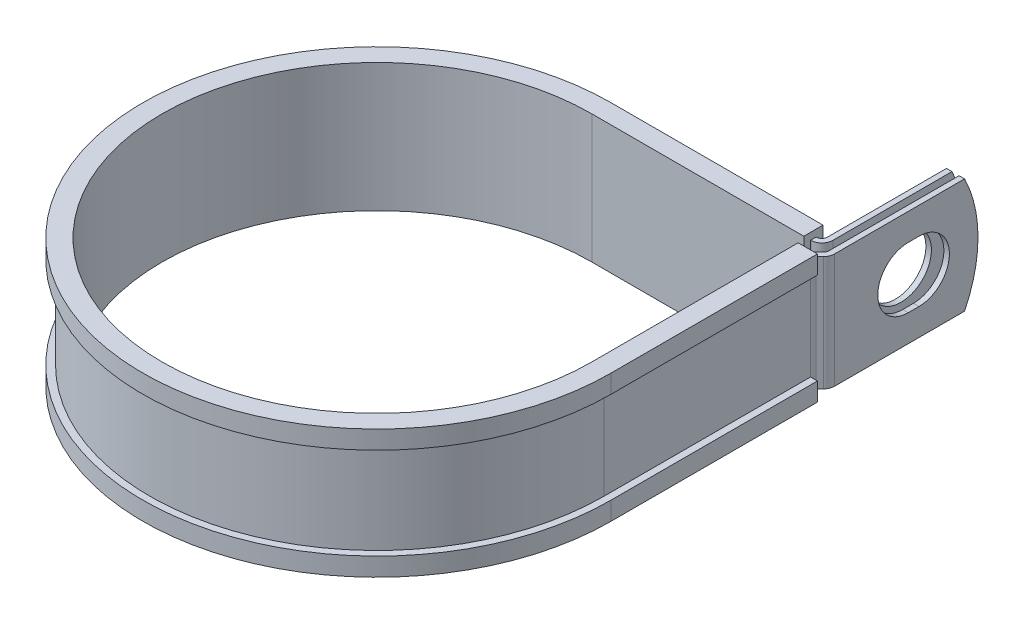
ISO-10303-21;
HEADER;
FILE_DESCRIPTION(('STEP AP214'),'2;1');
FILE_NAME('part.step','',(''),(''),'','','');
FILE_SCHEMA(('AUTOMOTIVE_DESIGN { 1 0 10303 214 1 1 1 1 }'));
ENDSEC;
DATA;
#1=APPLICATION_CONTEXT('core data for automotive mechanical design processes');
#2=APPLICATION_PROTOCOL_DEFINITION('international standard','automotive_design',2000,#1);
#3=PRODUCT_CONTEXT('',#1,'mechanical');
#4=PRODUCT('Part','Part','',(#3));
#5=PRODUCT_RELATED_PRODUCT_CATEGORY('part','',(#4));
#6=PRODUCT_DEFINITION_FORMATION('','',#4);
#7=PRODUCT_DEFINITION_CONTEXT('part definition',#1,'design');
#8=PRODUCT_DEFINITION('design','',#6,#7);
#9=PRODUCT_DEFINITION_SHAPE('','',#8);
#10=(LENGTH_UNIT() NAMED_UNIT(*) SI_UNIT(.MILLI.,.METRE.));
#11=(NAMED_UNIT(*) PLANE_ANGLE_UNIT() SI_UNIT($,.RADIAN.));
#12=(NAMED_UNIT(*) SI_UNIT($,.STERADIAN.) SOLID_ANGLE_UNIT());
#13=UNCERTAINTY_MEASURE_WITH_UNIT(LENGTH_MEASURE(1.E-05),#10,'distance_accuracy_value','');
#14=(GEOMETRIC_REPRESENTATION_CONTEXT(3) GLOBAL_UNCERTAINTY_ASSIGNED_CONTEXT((#13)) GLOBAL_UNIT_ASSIGNED_CONTEXT((#10,
#11,#12)) REPRESENTATION_CONTEXT('',''));
#15=CARTESIAN_POINT('',(0.,0.,0.));
#16=DIRECTION('',(0.,0.,1.));
#17=DIRECTION('',(1.,0.,0.));
#18=AXIS2_PLACEMENT_3D('',#15,#16,#17);
#19=CARTESIAN_POINT('',(49.8272698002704,-12.7,-49.149));
#20=DIRECTION('',(0.,1.,0.));
#21=DIRECTION('',(1.,0.,0.));
#22=AXIS2_PLACEMENT_3D('',#19,#20,#21);
#23=PLANE('',#22);
#24=DIRECTION('',(0.,0.,-1.));
#25=VECTOR('',#24,1.);
#26=CARTESIAN_POINT('',(46.9824698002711,-12.7,-49.149));
#27=LINE('',#26,#25);
#28=CARTESIAN_POINT('',(46.9824698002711,-12.7,-49.149));
#29=VERTEX_POINT('',#28);
#30=CARTESIAN_POINT('',(46.9824698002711,-12.7,-50.3682));
#31=VERTEX_POINT('',#30);
#32=EDGE_CURVE('E524',#29,#31,#27,.T.);
#33=ORIENTED_EDGE('',*,*,#32,.T.);
#34=DIRECTION('',(1.,0.,0.));
#35=VECTOR('',#34,1.);
#36=CARTESIAN_POINT('',(0.,-12.7,-50.3682));
#37=LINE('',#36,#35);
#38=CARTESIAN_POINT('',(47.0332698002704,-12.7,-50.3682));
#39=VERTEX_POINT('',#38);
#40=EDGE_CURVE('E411',#39,#31,#37,.F.);
#41=ORIENTED_EDGE('',*,*,#40,.F.);
#42=CARTESIAN_POINT('',(47.0332698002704,-12.7,-51.5874));
#43=DIRECTION('',(0.,1.,0.));
#44=DIRECTION('',(1.,0.,0.));
#45=AXIS2_PLACEMENT_3D('',#42,#43,#44);
#46=CIRCLE('',#45,1.2192);
#47=CARTESIAN_POINT('',(48.2524698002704,-12.7,-51.5874));
#48=VERTEX_POINT('',#47);
#49=EDGE_CURVE('E409',#48,#39,#46,.F.);
#50=ORIENTED_EDGE('',*,*,#49,.F.);
#51=DIRECTION('',(0.,0.,1.));
#52=VECTOR('',#51,1.);
#53=CARTESIAN_POINT('',(48.2524698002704,-12.7,-80.9498));
#54=LINE('',#53,#52);
#55=CARTESIAN_POINT('',(48.2524698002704,-12.7,-77.9724683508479));
#56=VERTEX_POINT('',#55);
#57=EDGE_CURVE('E407',#56,#48,#54,.T.);
#58=ORIENTED_EDGE('',*,*,#57,.F.);
#59=DIRECTION('',(-1.,0.,0.));
#60=VECTOR('',#59,1.);
#61=CARTESIAN_POINT('',(52.2656698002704,-12.7,-77.9724683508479));
#62=LINE('',#61,#60);
#63=CARTESIAN_POINT('',(49.4716698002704,-12.7,-77.9724683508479));
#64=VERTEX_POINT('',#63);
#65=EDGE_CURVE('E12',#64,#56,#62,.T.);
#66=ORIENTED_EDGE('',*,*,#65,.F.);
#67=DIRECTION('',(0.,0.,1.));
#68=VECTOR('',#67,1.);
#69=CARTESIAN_POINT('',(49.4716698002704,-12.7,-80.9498));
#70=LINE('',#69,#68);
#71=CARTESIAN_POINT('',(49.4716698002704,-12.7,-51.5874));
#72=VERTEX_POINT('',#71);
#73=EDGE_CURVE('E405',#64,#72,#70,.T.);
#74=ORIENTED_EDGE('',*,*,#73,.T.);
#75=CARTESIAN_POINT('',(47.0332698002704,-12.7,-51.5874));
#76=DIRECTION('',(0.,-1.,0.));
#77=DIRECTION('',(0.,0.,1.));
#78=AXIS2_PLACEMENT_3D('',#75,#76,#77);
#79=CIRCLE('',#78,2.4384);
#80=CARTESIAN_POINT('',(47.0332698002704,-12.7,-49.149));
#81=VERTEX_POINT('',#80);
#82=EDGE_CURVE('E402',#72,#81,#79,.T.);
#83=ORIENTED_EDGE('',*,*,#82,.T.);
#84=DIRECTION('',(-1.,0.,0.));
#85=VECTOR('',#84,1.);
#86=CARTESIAN_POINT('',(0.,-12.7,-49.149));
#87=LINE('',#86,#85);
#88=EDGE_CURVE('E399',#81,#29,#87,.T.);
#89=ORIENTED_EDGE('',*,*,#88,.T.);
#90=EDGE_LOOP('',(#33,#41,#50,#58,#66,#74,#83,#89));
#91=FACE_BOUND('',#90,.T.);
#92=ADVANCED_FACE('F55',(#91),#23,.F.);
#93=CARTESIAN_POINT('',(49.8272698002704,12.7,-49.149));
#94=DIRECTION('',(0.,1.,0.));
#95=DIRECTION('',(1.,0.,0.));
#96=AXIS2_PLACEMENT_3D('',#93,#94,#95);
#97=PLANE('',#96);
#98=DIRECTION('',(1.,0.,0.));
#99=VECTOR('',#98,1.);
#100=CARTESIAN_POINT('',(0.,12.7,-50.3682));
#101=LINE('',#100,#99);
#102=CARTESIAN_POINT('',(47.0332698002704,12.7,-50.3682));
#103=VERTEX_POINT('',#102);
#104=CARTESIAN_POINT('',(46.9824698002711,12.7,-50.3682));
#105=VERTEX_POINT('',#104);
#106=EDGE_CURVE('E369',#103,#105,#101,.F.);
#107=ORIENTED_EDGE('',*,*,#106,.T.);
#108=DIRECTION('',(0.,0.,1.));
#109=VECTOR('',#108,1.);
#110=CARTESIAN_POINT('',(46.9824698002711,12.7,-50.3682));
#111=LINE('',#110,#109);
#112=CARTESIAN_POINT('',(46.9824698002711,12.7,-49.149));
#113=VERTEX_POINT('',#112);
#114=EDGE_CURVE('E518',#105,#113,#111,.T.);
#115=ORIENTED_EDGE('',*,*,#114,.T.);
#116=DIRECTION('',(-1.,0.,0.));
#117=VECTOR('',#116,1.);
#118=CARTESIAN_POINT('',(0.,12.7,-49.149));
#119=LINE('',#118,#117);
#120=CARTESIAN_POINT('',(47.0332698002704,12.7,-49.149));
#121=VERTEX_POINT('',#120);
#122=EDGE_CURVE('E626',#121,#113,#119,.T.);
#123=ORIENTED_EDGE('',*,*,#122,.F.);
#124=CARTESIAN_POINT('',(47.0332698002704,12.7,-51.5874));
#125=DIRECTION('',(0.,-1.,0.));
#126=DIRECTION('',(0.,0.,1.));
#127=AXIS2_PLACEMENT_3D('',#124,#125,#126);
#128=CIRCLE('',#127,2.4384);
#129=CARTESIAN_POINT('',(49.4716698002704,12.7,-51.5874));
#130=VERTEX_POINT('',#129);
#131=EDGE_CURVE('E371',#130,#121,#128,.T.);
#132=ORIENTED_EDGE('',*,*,#131,.F.);
#133=DIRECTION('',(0.,0.,1.));
#134=VECTOR('',#133,1.);
#135=CARTESIAN_POINT('',(49.4716698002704,12.7,-80.9498));
#136=LINE('',#135,#134);
#137=CARTESIAN_POINT('',(49.4716698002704,12.7,-77.9724683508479));
#138=VERTEX_POINT('',#137);
#139=EDGE_CURVE('E362',#138,#130,#136,.T.);
#140=ORIENTED_EDGE('',*,*,#139,.F.);
#141=DIRECTION('',(-1.,0.,0.));
#142=VECTOR('',#141,1.);
#143=CARTESIAN_POINT('',(52.2656698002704,12.7,-77.9724683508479));
#144=LINE('',#143,#142);
#145=CARTESIAN_POINT('',(48.2524698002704,12.7,-77.9724683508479));
#146=VERTEX_POINT('',#145);
#147=EDGE_CURVE('E63',#138,#146,#144,.T.);
#148=ORIENTED_EDGE('',*,*,#147,.T.);
#149=DIRECTION('',(0.,0.,1.));
#150=VECTOR('',#149,1.);
#151=CARTESIAN_POINT('',(48.2524698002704,12.7,-80.9498));
#152=LINE('',#151,#150);
#153=CARTESIAN_POINT('',(48.2524698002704,12.7,-51.5874));
#154=VERTEX_POINT('',#153);
#155=EDGE_CURVE('E359',#146,#154,#152,.T.);
#156=ORIENTED_EDGE('',*,*,#155,.T.);
#157=CARTESIAN_POINT('',(47.0332698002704,12.7,-51.5874));
#158=DIRECTION('',(0.,1.,0.));
#159=DIRECTION('',(1.,0.,0.));
#160=AXIS2_PLACEMENT_3D('',#157,#158,#159);
#161=CIRCLE('',#160,1.2192);
#162=EDGE_CURVE('E367',#154,#103,#161,.F.);
#163=ORIENTED_EDGE('',*,*,#162,.T.);
#164=EDGE_LOOP('',(#107,#115,#123,#132,#140,#148,#156,#163));
#165=FACE_BOUND('',#164,.T.);
#166=ADVANCED_FACE('F358',(#165),#97,.T.);
#167=CARTESIAN_POINT('',(0.,12.7,-49.149));
#168=DIRECTION('',(0.,0.,1.));
#169=DIRECTION('',(1.,0.,0.));
#170=AXIS2_PLACEMENT_3D('',#167,#168,#169);
#171=PLANE('',#170);
#172=ORIENTED_EDGE('',*,*,#122,.T.);
#173=DIRECTION('',(0.,-1.,0.));
#174=VECTOR('',#173,1.);
#175=CARTESIAN_POINT('',(46.9824698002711,12.7,-49.149));
#176=LINE('',#175,#174);
#177=EDGE_CURVE('E521',#113,#29,#176,.T.);
#178=ORIENTED_EDGE('',*,*,#177,.T.);
#179=ORIENTED_EDGE('',*,*,#88,.F.);
#180=DIRECTION('',(0.,-1.,0.));
#181=VECTOR('',#180,1.);
#182=CARTESIAN_POINT('',(47.0332698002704,12.7,-49.149));
#183=LINE('',#182,#181);
#184=EDGE_CURVE('E345',#121,#81,#183,.T.);
#185=ORIENTED_EDGE('',*,*,#184,.F.);
#186=EDGE_LOOP('',(#172,#178,#179,#185));
#187=FACE_BOUND('',#186,.T.);
#188=ADVANCED_FACE('F636',(#187),#171,.T.);
#189=CARTESIAN_POINT('',(52.2656698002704,12.7,-49.149));
#190=DIRECTION('',(-1.,0.,0.));
#191=DIRECTION('',(0.,0.,1.));
#192=AXIS2_PLACEMENT_3D('',#189,#190,#191);
#193=PLANE('',#192);
#194=CARTESIAN_POINT('',(52.2656698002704,0.,-67.8687999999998));
#195=DIRECTION('',(1.,0.,0.));
#196=DIRECTION('',(0.,0.,-1.));
#197=AXIS2_PLACEMENT_3D('',#194,#195,#196);
#198=CIRCLE('',#197,6.7437);
#199=CARTESIAN_POINT('',(52.2656698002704,-6.7437,-67.8688000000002));
#200=VERTEX_POINT('',#199);
#201=CARTESIAN_POINT('',(52.2656698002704,6.7437,-67.8688000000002));
#202=VERTEX_POINT('',#201);
#203=EDGE_CURVE('E581',#200,#202,#198,.T.);
#204=ORIENTED_EDGE('',*,*,#203,.F.);
#205=DIRECTION('',(0.,0.,-1.));
#206=VECTOR('',#205,1.);
#207=CARTESIAN_POINT('',(52.2656698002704,-6.7437,-65.4811999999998));
#208=LINE('',#207,#206);
#209=CARTESIAN_POINT('',(52.2656698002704,-6.7437,-65.4811999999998));
#210=VERTEX_POINT('',#209);
#211=EDGE_CURVE('E584',#210,#200,#208,.T.);
#212=ORIENTED_EDGE('',*,*,#211,.F.);
#213=CARTESIAN_POINT('',(52.2656698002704,0.,-65.4811999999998));
#214=DIRECTION('',(1.,0.,0.));
#215=DIRECTION('',(0.,0.,-1.));
#216=AXIS2_PLACEMENT_3D('',#213,#214,#215);
#217=CIRCLE('',#216,6.7437);
#218=CARTESIAN_POINT('',(52.2656698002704,6.7437,-65.4811999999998));
#219=VERTEX_POINT('',#218);
#220=EDGE_CURVE('E577',#219,#210,#217,.T.);
#221=ORIENTED_EDGE('',*,*,#220,.F.);
#222=DIRECTION('',(0.,0.,1.));
#223=VECTOR('',#222,1.);
#224=CARTESIAN_POINT('',(52.2656698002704,6.7437,-65.4811999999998));
#225=LINE('',#224,#223);
#226=EDGE_CURVE('E578',#202,#219,#225,.T.);
#227=ORIENTED_EDGE('',*,*,#226,.F.);
#228=EDGE_LOOP('',(#204,#212,#221,#227));
#229=FACE_BOUND('',#228,.T.);
#230=DIRECTION('',(0.,0.,-1.));
#231=VECTOR('',#230,1.);
#232=CARTESIAN_POINT('',(52.2656698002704,-12.7,-49.149));
#233=LINE('',#232,#231);
#234=CARTESIAN_POINT('',(52.2656698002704,-12.7,-49.149));
#235=VERTEX_POINT('',#234);
#236=CARTESIAN_POINT('',(52.2656698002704,-12.7,-77.9724683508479));
#237=VERTEX_POINT('',#236);
#238=EDGE_CURVE('E383',#235,#237,#233,.T.);
#239=ORIENTED_EDGE('',*,*,#238,.T.);
#240=CARTESIAN_POINT('',(52.2656698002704,0.,-52.3748));
#241=DIRECTION('',(-1.,0.,0.));
#242=DIRECTION('',(0.,0.,1.));
#243=AXIS2_PLACEMENT_3D('',#240,#241,#242);
#244=CIRCLE('',#243,28.575);
#245=CARTESIAN_POINT('',(52.2656698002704,12.7,-77.9724683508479));
#246=VERTEX_POINT('',#245);
#247=EDGE_CURVE('E569',#246,#237,#244,.T.);
#248=ORIENTED_EDGE('',*,*,#247,.F.);
#249=DIRECTION('',(0.,0.,-1.));
#250=VECTOR('',#249,1.);
#251=CARTESIAN_POINT('',(52.2656698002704,12.7,-49.149));
#252=LINE('',#251,#250);
#253=CARTESIAN_POINT('',(52.2656698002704,12.7,-49.149));
#254=VERTEX_POINT('',#253);
#255=EDGE_CURVE('E420',#254,#246,#252,.T.);
#256=ORIENTED_EDGE('',*,*,#255,.F.);
#257=DIRECTION('',(0.,-1.,0.));
#258=VECTOR('',#257,1.);
#259=CARTESIAN_POINT('',(52.2656698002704,12.7,-49.149));
#260=LINE('',#259,#258);
#261=EDGE_CURVE('E382',#254,#235,#260,.T.);
#262=ORIENTED_EDGE('',*,*,#261,.T.);
#263=EDGE_LOOP('',(#239,#248,#256,#262));
#264=FACE_BOUND('',#263,.T.);
#265=ADVANCED_FACE('F57',(#229,#264),#193,.F.);
#266=CARTESIAN_POINT('',(51.0464698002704,12.7,-49.149));
#267=DIRECTION('',(-1.,0.,0.));
#268=DIRECTION('',(0.,0.,1.));
#269=AXIS2_PLACEMENT_3D('',#266,#267,#268);
#270=PLANE('',#269);
#271=DIRECTION('',(0.,0.,-1.));
#272=VECTOR('',#271,1.);
#273=CARTESIAN_POINT('',(51.0464698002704,-6.7437,-65.4811999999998));
#274=LINE('',#273,#272);
#275=CARTESIAN_POINT('',(51.0464698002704,-6.7437,-65.4811999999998));
#276=VERTEX_POINT('',#275);
#277=CARTESIAN_POINT('',(51.0464698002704,-6.7437,-67.8688000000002));
#278=VERTEX_POINT('',#277);
#279=EDGE_CURVE('E580',#276,#278,#274,.T.);
#280=ORIENTED_EDGE('',*,*,#279,.T.);
#281=CARTESIAN_POINT('',(51.0464698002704,0.,-67.8687999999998));
#282=DIRECTION('',(-1.,0.,0.));
#283=DIRECTION('',(0.,0.,1.));
#284=AXIS2_PLACEMENT_3D('',#281,#282,#283);
#285=CIRCLE('',#284,6.7437);
#286=CARTESIAN_POINT('',(51.0464698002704,6.7437,-67.8688000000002));
#287=VERTEX_POINT('',#286);
#288=EDGE_CURVE('E601',#278,#287,#285,.F.);
#289=ORIENTED_EDGE('',*,*,#288,.T.);
#290=DIRECTION('',(0.,0.,1.));
#291=VECTOR('',#290,1.);
#292=CARTESIAN_POINT('',(51.0464698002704,6.7437,-65.4811999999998));
#293=LINE('',#292,#291);
#294=CARTESIAN_POINT('',(51.0464698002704,6.7437,-65.4811999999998));
#295=VERTEX_POINT('',#294);
#296=EDGE_CURVE('E597',#287,#295,#293,.T.);
#297=ORIENTED_EDGE('',*,*,#296,.T.);
#298=CARTESIAN_POINT('',(51.0464698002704,0.,-65.4811999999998));
#299=DIRECTION('',(-1.,0.,0.));
#300=DIRECTION('',(0.,0.,1.));
#301=AXIS2_PLACEMENT_3D('',#298,#299,#300);
#302=CIRCLE('',#301,6.7437);
#303=EDGE_CURVE('E592',#295,#276,#302,.F.);
#304=ORIENTED_EDGE('',*,*,#303,.T.);
#305=EDGE_LOOP('',(#280,#289,#297,#304));
#306=FACE_BOUND('',#305,.T.);
#307=CARTESIAN_POINT('',(51.0464698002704,0.,-52.3748));
#308=DIRECTION('',(-1.,0.,0.));
#309=DIRECTION('',(0.,0.,1.));
#310=AXIS2_PLACEMENT_3D('',#307,#308,#309);
#311=CIRCLE('',#310,28.575);
#312=CARTESIAN_POINT('',(51.0464698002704,12.7,-77.9724683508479));
#313=VERTEX_POINT('',#312);
#314=CARTESIAN_POINT('',(51.0464698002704,-12.7,-77.9724683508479));
#315=VERTEX_POINT('',#314);
#316=EDGE_CURVE('E77',#313,#315,#311,.T.);
#317=ORIENTED_EDGE('',*,*,#316,.T.);
#318=DIRECTION('',(0.,0.,-1.));
#319=VECTOR('',#318,1.);
#320=CARTESIAN_POINT('',(51.0464698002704,-12.7,-49.149));
#321=LINE('',#320,#319);
#322=CARTESIAN_POINT('',(51.0464698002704,-12.7,-49.149));
#323=VERTEX_POINT('',#322);
#324=EDGE_CURVE('E386',#323,#315,#321,.T.);
#325=ORIENTED_EDGE('',*,*,#324,.F.);
#326=DIRECTION('',(0.,-1.,0.));
#327=VECTOR('',#326,1.);
#328=CARTESIAN_POINT('',(51.0464698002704,12.7,-49.149));
#329=LINE('',#328,#327);
#330=CARTESIAN_POINT('',(51.0464698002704,12.7,-49.149));
#331=VERTEX_POINT('',#330);
#332=EDGE_CURVE('E353',#331,#323,#329,.T.);
#333=ORIENTED_EDGE('',*,*,#332,.F.);
#334=DIRECTION('',(0.,0.,-1.));
#335=VECTOR('',#334,1.);
#336=CARTESIAN_POINT('',(51.0464698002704,12.7,-49.149));
#337=LINE('',#336,#335);
#338=EDGE_CURVE('E616',#331,#313,#337,.T.);
#339=ORIENTED_EDGE('',*,*,#338,.T.);
#340=EDGE_LOOP('',(#317,#325,#333,#339));
#341=FACE_BOUND('',#340,.T.);
#342=ADVANCED_FACE('F690',(#306,#341),#270,.T.);
#343=CARTESIAN_POINT('',(49.4716698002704,12.7,-80.9498));
#344=DIRECTION('',(1.,0.,0.));
#345=DIRECTION('',(0.,0.,-1.));
#346=AXIS2_PLACEMENT_3D('',#343,#344,#345);
#347=PLANE('',#346);
#348=CARTESIAN_POINT('',(49.4716698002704,0.,-66.675));
#349=DIRECTION('',(1.,0.,0.));
#350=DIRECTION('',(0.,0.,-1.));
#351=AXIS2_PLACEMENT_3D('',#348,#349,#350);
#352=CIRCLE('',#351,6.7437);
#353=CARTESIAN_POINT('',(49.4716698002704,0.,-73.4187));
#354=VERTEX_POINT('',#353);
#355=EDGE_CURVE('E387',#354,#354,#352,.F.);
#356=ORIENTED_EDGE('',*,*,#355,.T.);
#357=EDGE_LOOP('',(#356));
#358=FACE_BOUND('',#357,.T.);
#359=ORIENTED_EDGE('',*,*,#73,.F.);
#360=CARTESIAN_POINT('',(49.4716698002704,0.,-52.3748));
#361=DIRECTION('',(1.,0.,0.));
#362=DIRECTION('',(0.,0.,-1.));
#363=AXIS2_PLACEMENT_3D('',#360,#361,#362);
#364=CIRCLE('',#363,28.575);
#365=EDGE_CURVE('E574',#64,#138,#364,.T.);
#366=ORIENTED_EDGE('',*,*,#365,.T.);
#367=ORIENTED_EDGE('',*,*,#139,.T.);
#368=DIRECTION('',(0.,-1.,0.));
#369=VECTOR('',#368,1.);
#370=CARTESIAN_POINT('',(49.4716698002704,12.7,-51.5874));
#371=LINE('',#370,#369);
#372=EDGE_CURVE('E342',#130,#72,#371,.T.);
#373=ORIENTED_EDGE('',*,*,#372,.T.);
#374=EDGE_LOOP('',(#359,#366,#367,#373));
#375=FACE_BOUND('',#374,.T.);
#376=ADVANCED_FACE('F642',(#358,#375),#347,.T.);
#377=CARTESIAN_POINT('',(48.2524698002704,12.7,-80.9498));
#378=DIRECTION('',(1.,0.,0.));
#379=DIRECTION('',(0.,0.,-1.));
#380=AXIS2_PLACEMENT_3D('',#377,#378,#379);
#381=PLANE('',#380);
#382=CARTESIAN_POINT('',(48.2524698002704,0.,-66.675));
#383=DIRECTION('',(-1.,0.,0.));
#384=DIRECTION('',(0.,0.,1.));
#385=AXIS2_PLACEMENT_3D('',#382,#383,#384);
#386=CIRCLE('',#385,6.7437);
#387=CARTESIAN_POINT('',(48.2524698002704,0.,-59.9313));
#388=VERTEX_POINT('',#387);
#389=EDGE_CURVE('E609',#388,#388,#386,.T.);
#390=ORIENTED_EDGE('',*,*,#389,.F.);
#391=EDGE_LOOP('',(#390));
#392=FACE_BOUND('',#391,.T.);
#393=CARTESIAN_POINT('',(48.2524698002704,0.,-52.3748));
#394=DIRECTION('',(-1.,0.,0.));
#395=DIRECTION('',(0.,0.,1.));
#396=AXIS2_PLACEMENT_3D('',#393,#394,#395);
#397=CIRCLE('',#396,28.575);
#398=EDGE_CURVE('E69',#146,#56,#397,.T.);
#399=ORIENTED_EDGE('',*,*,#398,.T.);
#400=ORIENTED_EDGE('',*,*,#57,.T.);
#401=DIRECTION('',(0.,-1.,0.));
#402=VECTOR('',#401,1.);
#403=CARTESIAN_POINT('',(48.2524698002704,12.7,-51.5874));
#404=LINE('',#403,#402);
#405=EDGE_CURVE('E339',#154,#48,#404,.T.);
#406=ORIENTED_EDGE('',*,*,#405,.F.);
#407=ORIENTED_EDGE('',*,*,#155,.F.);
#408=EDGE_LOOP('',(#399,#400,#406,#407));
#409=FACE_BOUND('',#408,.T.);
#410=ADVANCED_FACE('F365',(#392,#409),#381,.F.);
#411=CARTESIAN_POINT('',(51.5874,-12.7,-45.7365026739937));
#412=DIRECTION('',(0.,1.,0.));
#413=DIRECTION('',(1.,0.,0.));
#414=AXIS2_PLACEMENT_3D('',#411,#412,#413);
#415=CIRCLE('',#414,1.2192);
#416=CARTESIAN_POINT('',(50.3682,-12.7,-45.7365026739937));
#417=VERTEX_POINT('',#416);
#418=CARTESIAN_POINT('',(50.7252954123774,-12.7,-46.5986072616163));
#419=VERTEX_POINT('',#418);
#420=EDGE_CURVE('E414',#417,#419,#415,.F.);
#421=ORIENTED_EDGE('',*,*,#420,.F.);
#422=DIRECTION('',(1.,0.,0.));
#423=VECTOR('',#422,1.);
#424=CARTESIAN_POINT('',(49.149,-12.7,-45.7365026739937));
#425=LINE('',#424,#423);
#426=CARTESIAN_POINT('',(49.149,-12.7,-45.7365026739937));
#427=VERTEX_POINT('',#426);
#428=EDGE_CURVE('E452',#427,#417,#425,.T.);
#429=ORIENTED_EDGE('',*,*,#428,.F.);
#430=CARTESIAN_POINT('',(51.5874,-12.7,-45.7365026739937));
#431=DIRECTION('',(0.,-1.,0.));
#432=DIRECTION('',(0.,0.,1.));
#433=AXIS2_PLACEMENT_3D('',#430,#431,#432);
#434=CIRCLE('',#433,2.4384);
#435=CARTESIAN_POINT('',(49.8631908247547,-12.7,-47.460711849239));
#436=VERTEX_POINT('',#435);
#437=EDGE_CURVE('E396',#427,#436,#434,.T.);
#438=ORIENTED_EDGE('',*,*,#437,.T.);
#439=DIRECTION('',(0.707106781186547,0.,-0.707106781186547));
#440=VECTOR('',#439,1.);
#441=CARTESIAN_POINT('',(49.8631908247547,-12.7,-47.460711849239));
#442=LINE('',#441,#440);
#443=CARTESIAN_POINT('',(50.6893743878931,-12.7,-48.2868954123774));
#444=VERTEX_POINT('',#443);
#445=EDGE_CURVE('E393',#436,#444,#442,.T.);
#446=ORIENTED_EDGE('',*,*,#445,.T.);
#447=CARTESIAN_POINT('',(49.8272698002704,-12.7,-49.149));
#448=DIRECTION('',(0.,1.,0.));
#449=DIRECTION('',(0.,0.,1.));
#450=AXIS2_PLACEMENT_3D('',#447,#448,#449);
#451=CIRCLE('',#450,1.21920000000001);
#452=EDGE_CURVE('E390',#444,#323,#451,.T.);
#453=ORIENTED_EDGE('',*,*,#452,.T.);
#454=ORIENTED_EDGE('',*,*,#324,.T.);
#455=DIRECTION('',(-1.,0.,0.));
#456=VECTOR('',#455,1.);
#457=CARTESIAN_POINT('',(52.2656698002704,-12.7,-77.9724683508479));
#458=LINE('',#457,#456);
#459=EDGE_CURVE('E567',#237,#315,#458,.T.);
#460=ORIENTED_EDGE('',*,*,#459,.F.);
#461=ORIENTED_EDGE('',*,*,#238,.F.);
#462=CARTESIAN_POINT('',(49.8272698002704,-12.7,-49.149));
#463=DIRECTION('',(0.,1.,0.));
#464=DIRECTION('',(1.,0.,0.));
#465=AXIS2_PLACEMENT_3D('',#462,#463,#464);
#466=CIRCLE('',#465,2.43840000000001);
#467=CARTESIAN_POINT('',(51.5514789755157,-12.7,-47.4247908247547));
#468=VERTEX_POINT('',#467);
#469=EDGE_CURVE('E418',#468,#235,#466,.T.);
#470=ORIENTED_EDGE('',*,*,#469,.F.);
#471=DIRECTION('',(0.707106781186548,0.,-0.707106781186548));
#472=VECTOR('',#471,1.);
#473=CARTESIAN_POINT('',(50.7252954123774,-12.7,-46.5986072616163));
#474=LINE('',#473,#472);
#475=EDGE_CURVE('E416',#419,#468,#474,.T.);
#476=ORIENTED_EDGE('',*,*,#475,.F.);
#477=EDGE_LOOP('',(#421,#429,#438,#446,#453,#454,#460,#461,#470,#476));
#478=FACE_BOUND('',#477,.T.);
#479=ADVANCED_FACE('F676',(#478),#23,.F.);
#480=DIRECTION('',(-1.,0.,0.));
#481=VECTOR('',#480,1.);
#482=CARTESIAN_POINT('',(50.3682,12.7,-45.7365026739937));
#483=LINE('',#482,#481);
#484=CARTESIAN_POINT('',(50.3682,12.7,-45.7365026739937));
#485=VERTEX_POINT('',#484);
#486=CARTESIAN_POINT('',(49.149,12.7,-45.7365026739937));
#487=VERTEX_POINT('',#486);
#488=EDGE_CURVE('E441',#485,#487,#483,.T.);
#489=ORIENTED_EDGE('',*,*,#488,.F.);
#490=CARTESIAN_POINT('',(51.5874,12.7,-45.7365026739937));
#491=DIRECTION('',(0.,1.,0.));
#492=DIRECTION('',(1.,0.,0.));
#493=AXIS2_PLACEMENT_3D('',#490,#491,#492);
#494=CIRCLE('',#493,1.2192);
#495=CARTESIAN_POINT('',(50.7252954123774,12.7,-46.5986072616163));
#496=VERTEX_POINT('',#495);
#497=EDGE_CURVE('E376',#485,#496,#494,.F.);
#498=ORIENTED_EDGE('',*,*,#497,.T.);
#499=DIRECTION('',(0.707106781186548,0.,-0.707106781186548));
#500=VECTOR('',#499,1.);
#501=CARTESIAN_POINT('',(50.7252954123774,12.7,-46.5986072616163));
#502=LINE('',#501,#500);
#503=CARTESIAN_POINT('',(51.5514789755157,12.7,-47.4247908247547));
#504=VERTEX_POINT('',#503);
#505=EDGE_CURVE('E378',#496,#504,#502,.T.);
#506=ORIENTED_EDGE('',*,*,#505,.T.);
#507=CARTESIAN_POINT('',(49.8272698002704,12.7,-49.149));
#508=DIRECTION('',(0.,1.,0.));
#509=DIRECTION('',(1.,0.,0.));
#510=AXIS2_PLACEMENT_3D('',#507,#508,#509);
#511=CIRCLE('',#510,2.43840000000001);
#512=EDGE_CURVE('E380',#504,#254,#511,.T.);
#513=ORIENTED_EDGE('',*,*,#512,.T.);
#514=ORIENTED_EDGE('',*,*,#255,.T.);
#515=DIRECTION('',(-1.,0.,0.));
#516=VECTOR('',#515,1.);
#517=CARTESIAN_POINT('',(52.2656698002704,12.7,-77.9724683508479));
#518=LINE('',#517,#516);
#519=EDGE_CURVE('E571',#246,#313,#518,.T.);
#520=ORIENTED_EDGE('',*,*,#519,.T.);
#521=ORIENTED_EDGE('',*,*,#338,.F.);
#522=CARTESIAN_POINT('',(49.8272698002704,12.7,-49.149));
#523=DIRECTION('',(0.,1.,0.));
#524=DIRECTION('',(0.,0.,1.));
#525=AXIS2_PLACEMENT_3D('',#522,#523,#524);
#526=CIRCLE('',#525,1.21920000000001);
#527=CARTESIAN_POINT('',(50.6893743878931,12.7,-48.2868954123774));
#528=VERTEX_POINT('',#527);
#529=EDGE_CURVE('E619',#528,#331,#526,.T.);
#530=ORIENTED_EDGE('',*,*,#529,.F.);
#531=DIRECTION('',(0.707106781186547,0.,-0.707106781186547));
#532=VECTOR('',#531,1.);
#533=CARTESIAN_POINT('',(49.8631908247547,12.7,-47.460711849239));
#534=LINE('',#533,#532);
#535=CARTESIAN_POINT('',(49.8631908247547,12.7,-47.460711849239));
#536=VERTEX_POINT('',#535);
#537=EDGE_CURVE('E622',#536,#528,#534,.T.);
#538=ORIENTED_EDGE('',*,*,#537,.F.);
#539=CARTESIAN_POINT('',(51.5874,12.7,-45.7365026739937));
#540=DIRECTION('',(0.,-1.,0.));
#541=DIRECTION('',(0.,0.,1.));
#542=AXIS2_PLACEMENT_3D('',#539,#540,#541);
#543=CIRCLE('',#542,2.4384);
#544=EDGE_CURVE('E451',#487,#536,#543,.T.);
#545=ORIENTED_EDGE('',*,*,#544,.F.);
#546=EDGE_LOOP('',(#489,#498,#506,#513,#514,#520,#521,#530,#538,#545));
#547=FACE_BOUND('',#546,.T.);
#548=ADVANCED_FACE('F448',(#547),#97,.T.);
#549=CARTESIAN_POINT('',(49.8272698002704,12.7,-49.149));
#550=DIRECTION('',(0.,-1.,0.));
#551=DIRECTION('',(0.,0.,-1.));
#552=AXIS2_PLACEMENT_3D('',#549,#550,#551);
#553=CYLINDRICAL_SURFACE('',#552,1.21920000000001);
#554=ORIENTED_EDGE('',*,*,#452,.F.);
#555=DIRECTION('',(0.,-1.,0.));
#556=VECTOR('',#555,1.);
#557=CARTESIAN_POINT('',(50.6893743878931,12.7,-48.2868954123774));
#558=LINE('',#557,#556);
#559=EDGE_CURVE('E351',#528,#444,#558,.T.);
#560=ORIENTED_EDGE('',*,*,#559,.F.);
#561=ORIENTED_EDGE('',*,*,#529,.T.);
#562=ORIENTED_EDGE('',*,*,#332,.T.);
#563=EDGE_LOOP('',(#554,#560,#561,#562));
#564=FACE_BOUND('',#563,.T.);
#565=ADVANCED_FACE('F686',(#564),#553,.F.);
#566=CARTESIAN_POINT('',(49.8631908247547,12.7,-47.460711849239));
#567=DIRECTION('',(-0.707106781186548,0.,-0.707106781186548));
#568=DIRECTION('',(-0.707106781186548,0.,0.707106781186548));
#569=AXIS2_PLACEMENT_3D('',#566,#567,#568);
#570=PLANE('',#569);
#571=ORIENTED_EDGE('',*,*,#445,.F.);
#572=DIRECTION('',(0.,-1.,0.));
#573=VECTOR('',#572,1.);
#574=CARTESIAN_POINT('',(49.8631908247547,12.7,-47.460711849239));
#575=LINE('',#574,#573);
#576=EDGE_CURVE('E349',#536,#436,#575,.T.);
#577=ORIENTED_EDGE('',*,*,#576,.F.);
#578=ORIENTED_EDGE('',*,*,#537,.T.);
#579=ORIENTED_EDGE('',*,*,#559,.T.);
#580=EDGE_LOOP('',(#571,#577,#578,#579));
#581=FACE_BOUND('',#580,.T.);
#582=ADVANCED_FACE('F681',(#581),#570,.T.);
#583=CARTESIAN_POINT('',(51.5874,12.7,-45.7365026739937));
#584=DIRECTION('',(0.,-1.,0.));
#585=DIRECTION('',(0.,0.,-1.));
#586=AXIS2_PLACEMENT_3D('',#583,#584,#585);
#587=CYLINDRICAL_SURFACE('',#586,2.4384);
#588=ORIENTED_EDGE('',*,*,#437,.F.);
#589=DIRECTION('',(0.,-1.,0.));
#590=VECTOR('',#589,1.);
#591=CARTESIAN_POINT('',(49.149,12.7,-45.7365026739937));
#592=LINE('',#591,#590);
#593=EDGE_CURVE('E347',#487,#427,#592,.T.);
#594=ORIENTED_EDGE('',*,*,#593,.F.);
#595=ORIENTED_EDGE('',*,*,#544,.T.);
#596=ORIENTED_EDGE('',*,*,#576,.T.);
#597=EDGE_LOOP('',(#588,#594,#595,#596));
#598=FACE_BOUND('',#597,.T.);
#599=ADVANCED_FACE('F678',(#598),#587,.T.);
#600=CARTESIAN_POINT('',(47.0332698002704,12.7,-51.5874));
#601=DIRECTION('',(0.,-1.,0.));
#602=DIRECTION('',(0.,0.,-1.));
#603=AXIS2_PLACEMENT_3D('',#600,#601,#602);
#604=CYLINDRICAL_SURFACE('',#603,2.4384);
#605=ORIENTED_EDGE('',*,*,#82,.F.);
#606=ORIENTED_EDGE('',*,*,#372,.F.);
#607=ORIENTED_EDGE('',*,*,#131,.T.);
#608=ORIENTED_EDGE('',*,*,#184,.T.);
#609=EDGE_LOOP('',(#605,#606,#607,#608));
#610=FACE_BOUND('',#609,.T.);
#611=ADVANCED_FACE('F632',(#610),#604,.T.);
#612=CARTESIAN_POINT('',(47.0332698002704,12.7,-51.5874));
#613=DIRECTION('',(0.,-1.,0.));
#614=DIRECTION('',(0.,0.,-1.));
#615=AXIS2_PLACEMENT_3D('',#612,#613,#614);
#616=CYLINDRICAL_SURFACE('',#615,1.2192);
#617=ORIENTED_EDGE('',*,*,#49,.T.);
#618=DIRECTION('',(0.,-1.,0.));
#619=VECTOR('',#618,1.);
#620=CARTESIAN_POINT('',(47.0332698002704,12.7,-50.3682));
#621=LINE('',#620,#619);
#622=EDGE_CURVE('E330',#103,#39,#621,.T.);
#623=ORIENTED_EDGE('',*,*,#622,.F.);
#624=ORIENTED_EDGE('',*,*,#162,.F.);
#625=ORIENTED_EDGE('',*,*,#405,.T.);
#626=EDGE_LOOP('',(#617,#623,#624,#625));
#627=FACE_BOUND('',#626,.T.);
#628=ADVANCED_FACE('F647',(#627),#616,.F.);
#629=CARTESIAN_POINT('',(0.,12.7,-50.3682));
#630=DIRECTION('',(0.,0.,1.));
#631=DIRECTION('',(1.,0.,0.));
#632=AXIS2_PLACEMENT_3D('',#629,#630,#631);
#633=PLANE('',#632);
#634=DIRECTION('',(0.,-1.,0.));
#635=VECTOR('',#634,1.);
#636=CARTESIAN_POINT('',(0.,12.7,-50.3682));
#637=LINE('',#636,#635);
#638=CARTESIAN_POINT('',(7.06522684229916E-13,10.16,-50.3682));
#639=VERTEX_POINT('',#638);
#640=CARTESIAN_POINT('',(7.06522684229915E-13,-10.16,-50.3682));
#641=VERTEX_POINT('',#640);
#642=EDGE_CURVE('E321',#639,#641,#637,.T.);
#643=ORIENTED_EDGE('',*,*,#642,.F.);
#644=DIRECTION('',(1.,0.,0.));
#645=VECTOR('',#644,1.);
#646=CARTESIAN_POINT('',(7.06522684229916E-13,10.16,-50.3682));
#647=LINE('',#646,#645);
#648=CARTESIAN_POINT('',(46.9824698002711,10.16,-50.3682));
#649=VERTEX_POINT('',#648);
#650=EDGE_CURVE('E564',#639,#649,#647,.T.);
#651=ORIENTED_EDGE('',*,*,#650,.T.);
#652=DIRECTION('',(0.,1.,0.));
#653=VECTOR('',#652,1.);
#654=CARTESIAN_POINT('',(46.9824698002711,12.7,-50.3682));
#655=LINE('',#654,#653);
#656=EDGE_CURVE('E515',#649,#105,#655,.T.);
#657=ORIENTED_EDGE('',*,*,#656,.T.);
#658=ORIENTED_EDGE('',*,*,#106,.F.);
#659=ORIENTED_EDGE('',*,*,#622,.T.);
#660=ORIENTED_EDGE('',*,*,#40,.T.);
#661=DIRECTION('',(0.,1.,0.));
#662=VECTOR('',#661,1.);
#663=CARTESIAN_POINT('',(46.9824698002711,-12.7,-50.3682));
#664=LINE('',#663,#662);
#665=CARTESIAN_POINT('',(46.9824698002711,-10.16,-50.3682));
#666=VERTEX_POINT('',#665);
#667=EDGE_CURVE('E527',#31,#666,#664,.T.);
#668=ORIENTED_EDGE('',*,*,#667,.T.);
#669=DIRECTION('',(1.,0.,0.));
#670=VECTOR('',#669,1.);
#671=CARTESIAN_POINT('',(7.06522684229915E-13,-10.16,-50.3682));
#672=LINE('',#671,#670);
#673=EDGE_CURVE('E544',#641,#666,#672,.T.);
#674=ORIENTED_EDGE('',*,*,#673,.F.);
#675=EDGE_LOOP('',(#643,#651,#657,#658,#659,#660,#668,#674));
#676=FACE_BOUND('',#675,.T.);
#677=ADVANCED_FACE('F651',(#676),#633,.F.);
#678=CARTESIAN_POINT('',(0.,12.7,0.));
#679=DIRECTION('',(0.,-1.,0.));
#680=DIRECTION('',(0.,0.,-1.));
#681=AXIS2_PLACEMENT_3D('',#678,#679,#680);
#682=CYLINDRICAL_SURFACE('',#681,50.3682);
#683=DIRECTION('',(0.,-1.,0.));
#684=VECTOR('',#683,1.);
#685=CARTESIAN_POINT('',(50.3682,12.7,0.));
#686=LINE('',#685,#684);
#687=CARTESIAN_POINT('',(50.3682,10.16,0.));
#688=VERTEX_POINT('',#687);
#689=CARTESIAN_POINT('',(50.3682,-10.16,0.));
#690=VERTEX_POINT('',#689);
#691=EDGE_CURVE('E319',#688,#690,#686,.T.);
#692=ORIENTED_EDGE('',*,*,#691,.F.);
#693=CARTESIAN_POINT('',(0.,10.16,0.));
#694=DIRECTION('',(0.,-1.,0.));
#695=DIRECTION('',(0.,0.,-1.));
#696=AXIS2_PLACEMENT_3D('',#693,#694,#695);
#697=CIRCLE('',#696,50.3682);
#698=EDGE_CURVE('E513',#688,#639,#697,.T.);
#699=ORIENTED_EDGE('',*,*,#698,.T.);
#700=ORIENTED_EDGE('',*,*,#642,.T.);
#701=CARTESIAN_POINT('',(0.,-10.16,0.));
#702=DIRECTION('',(0.,-1.,0.));
#703=DIRECTION('',(0.,0.,-1.));
#704=AXIS2_PLACEMENT_3D('',#701,#702,#703);
#705=CIRCLE('',#704,50.3682);
#706=EDGE_CURVE('E302',#690,#641,#705,.T.);
#707=ORIENTED_EDGE('',*,*,#706,.F.);
#708=EDGE_LOOP('',(#692,#699,#700,#707));
#709=FACE_BOUND('',#708,.T.);
#710=ADVANCED_FACE('F317',(#709),#682,.T.);
#711=CARTESIAN_POINT('',(50.3682,12.7,0.));
#712=DIRECTION('',(-1.,0.,0.));
#713=DIRECTION('',(0.,0.,1.));
#714=AXIS2_PLACEMENT_3D('',#711,#712,#713);
#715=PLANE('',#714);
#716=DIRECTION('',(0.,-1.,0.));
#717=VECTOR('',#716,1.);
#718=CARTESIAN_POINT('',(50.3682,12.7,-45.7365026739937));
#719=LINE('',#718,#717);
#720=CARTESIAN_POINT('',(50.3682,10.16,-45.7365026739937));
#721=VERTEX_POINT('',#720);
#722=CARTESIAN_POINT('',(50.3682,-10.16,-45.7365026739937));
#723=VERTEX_POINT('',#722);
#724=EDGE_CURVE('E333',#721,#723,#719,.T.);
#725=ORIENTED_EDGE('',*,*,#724,.F.);
#726=DIRECTION('',(0.,0.,-1.));
#727=VECTOR('',#726,1.);
#728=CARTESIAN_POINT('',(50.3682,10.16,0.));
#729=LINE('',#728,#727);
#730=EDGE_CURVE('E327',#688,#721,#729,.T.);
#731=ORIENTED_EDGE('',*,*,#730,.F.);
#732=ORIENTED_EDGE('',*,*,#691,.T.);
#733=DIRECTION('',(0.,0.,-1.));
#734=VECTOR('',#733,1.);
#735=CARTESIAN_POINT('',(50.3682,-10.16,0.));
#736=LINE('',#735,#734);
#737=EDGE_CURVE('E298',#690,#723,#736,.T.);
#738=ORIENTED_EDGE('',*,*,#737,.T.);
#739=EDGE_LOOP('',(#725,#731,#732,#738));
#740=FACE_BOUND('',#739,.T.);
#741=ADVANCED_FACE('F326',(#740),#715,.F.);
#742=CARTESIAN_POINT('',(51.5874,12.7,-45.7365026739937));
#743=DIRECTION('',(0.,-1.,0.));
#744=DIRECTION('',(0.,0.,-1.));
#745=AXIS2_PLACEMENT_3D('',#742,#743,#744);
#746=CYLINDRICAL_SURFACE('',#745,1.2192);
#747=ORIENTED_EDGE('',*,*,#420,.T.);
#748=DIRECTION('',(0.,-1.,0.));
#749=VECTOR('',#748,1.);
#750=CARTESIAN_POINT('',(50.7252954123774,12.7,-46.5986072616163));
#751=LINE('',#750,#749);
#752=EDGE_CURVE('E425',#496,#419,#751,.T.);
#753=ORIENTED_EDGE('',*,*,#752,.F.);
#754=ORIENTED_EDGE('',*,*,#497,.F.);
#755=EDGE_CURVE('E328',#485,#721,#719,.T.);
#756=ORIENTED_EDGE('',*,*,#755,.T.);
#757=ORIENTED_EDGE('',*,*,#724,.T.);
#758=DIRECTION('',(0.,1.,0.));
#759=VECTOR('',#758,1.);
#760=CARTESIAN_POINT('',(50.3682,-12.7,-45.7365026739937));
#761=LINE('',#760,#759);
#762=EDGE_CURVE('E434',#417,#723,#761,.T.);
#763=ORIENTED_EDGE('',*,*,#762,.F.);
#764=EDGE_LOOP('',(#747,#753,#754,#756,#757,#763));
#765=FACE_BOUND('',#764,.T.);
#766=ADVANCED_FACE('F433',(#765),#746,.F.);
#767=CARTESIAN_POINT('',(50.7252954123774,12.7,-46.5986072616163));
#768=DIRECTION('',(-0.707106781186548,0.,-0.707106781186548));
#769=DIRECTION('',(-0.707106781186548,0.,0.707106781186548));
#770=AXIS2_PLACEMENT_3D('',#767,#768,#769);
#771=PLANE('',#770);
#772=ORIENTED_EDGE('',*,*,#475,.T.);
#773=DIRECTION('',(0.,-1.,0.));
#774=VECTOR('',#773,1.);
#775=CARTESIAN_POINT('',(51.5514789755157,12.7,-47.4247908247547));
#776=LINE('',#775,#774);
#777=EDGE_CURVE('E423',#504,#468,#776,.T.);
#778=ORIENTED_EDGE('',*,*,#777,.F.);
#779=ORIENTED_EDGE('',*,*,#505,.F.);
#780=ORIENTED_EDGE('',*,*,#752,.T.);
#781=EDGE_LOOP('',(#772,#778,#779,#780));
#782=FACE_BOUND('',#781,.T.);
#783=ADVANCED_FACE('F702',(#782),#771,.F.);
#784=CARTESIAN_POINT('',(49.8272698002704,12.7,-49.149));
#785=DIRECTION('',(0.,-1.,0.));
#786=DIRECTION('',(0.,0.,-1.));
#787=AXIS2_PLACEMENT_3D('',#784,#785,#786);
#788=CYLINDRICAL_SURFACE('',#787,2.43840000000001);
#789=ORIENTED_EDGE('',*,*,#469,.T.);
#790=ORIENTED_EDGE('',*,*,#261,.F.);
#791=ORIENTED_EDGE('',*,*,#512,.F.);
#792=ORIENTED_EDGE('',*,*,#777,.T.);
#793=EDGE_LOOP('',(#789,#790,#791,#792));
#794=FACE_BOUND('',#793,.T.);
#795=ADVANCED_FACE('F700',(#794),#788,.T.);
#796=CARTESIAN_POINT('',(68.5457338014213,0.,-66.675));
#797=DIRECTION('',(-1.,0.,0.));
#798=DIRECTION('',(0.,0.,1.));
#799=AXIS2_PLACEMENT_3D('',#796,#797,#798);
#800=CYLINDRICAL_SURFACE('',#799,6.7437);
#801=ORIENTED_EDGE('',*,*,#389,.T.);
#802=EDGE_LOOP('',(#801));
#803=FACE_BOUND('',#802,.T.);
#804=ORIENTED_EDGE('',*,*,#355,.F.);
#805=EDGE_LOOP('',(#804));
#806=FACE_BOUND('',#805,.T.);
#807=ADVANCED_FACE('F709',(#803,#806),#800,.F.);
#808=CARTESIAN_POINT('',(30.2155892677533,-6.7437,-65.4811999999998));
#809=DIRECTION('',(0.,-1.,0.));
#810=DIRECTION('',(0.,0.,-1.));
#811=AXIS2_PLACEMENT_3D('',#808,#809,#810);
#812=PLANE('',#811);
#813=DIRECTION('',(1.,0.,0.));
#814=VECTOR('',#813,1.);
#815=CARTESIAN_POINT('',(30.2155892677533,-6.7437,-65.4811999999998));
#816=LINE('',#815,#814);
#817=EDGE_CURVE('E595',#276,#210,#816,.T.);
#818=ORIENTED_EDGE('',*,*,#817,.T.);
#819=ORIENTED_EDGE('',*,*,#211,.T.);
#820=DIRECTION('',(1.,0.,0.));
#821=VECTOR('',#820,1.);
#822=CARTESIAN_POINT('',(30.2155892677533,-6.7437,-67.8688000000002));
#823=LINE('',#822,#821);
#824=EDGE_CURVE('E591',#278,#200,#823,.T.);
#825=ORIENTED_EDGE('',*,*,#824,.F.);
#826=ORIENTED_EDGE('',*,*,#279,.F.);
#827=EDGE_LOOP('',(#818,#819,#825,#826));
#828=FACE_BOUND('',#827,.T.);
#829=ADVANCED_FACE('F752',(#828),#812,.F.);
#830=CARTESIAN_POINT('',(30.2155892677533,0.,-67.8687999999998));
#831=DIRECTION('',(1.,0.,0.));
#832=DIRECTION('',(0.,0.,-1.));
#833=AXIS2_PLACEMENT_3D('',#830,#831,#832);
#834=CYLINDRICAL_SURFACE('',#833,6.7437);
#835=ORIENTED_EDGE('',*,*,#824,.T.);
#836=ORIENTED_EDGE('',*,*,#203,.T.);
#837=DIRECTION('',(1.,0.,0.));
#838=VECTOR('',#837,1.);
#839=CARTESIAN_POINT('',(30.2155892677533,6.7437,-67.8688000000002));
#840=LINE('',#839,#838);
#841=EDGE_CURVE('E600',#287,#202,#840,.T.);
#842=ORIENTED_EDGE('',*,*,#841,.F.);
#843=ORIENTED_EDGE('',*,*,#288,.F.);
#844=EDGE_LOOP('',(#835,#836,#842,#843));
#845=FACE_BOUND('',#844,.T.);
#846=ADVANCED_FACE('F756',(#845),#834,.F.);
#847=CARTESIAN_POINT('',(30.2155892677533,6.7437,-65.4811999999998));
#848=DIRECTION('',(0.,1.,0.));
#849=DIRECTION('',(0.,0.,1.));
#850=AXIS2_PLACEMENT_3D('',#847,#848,#849);
#851=PLANE('',#850);
#852=ORIENTED_EDGE('',*,*,#841,.T.);
#853=ORIENTED_EDGE('',*,*,#226,.T.);
#854=DIRECTION('',(1.,0.,0.));
#855=VECTOR('',#854,1.);
#856=CARTESIAN_POINT('',(30.2155892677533,6.7437,-65.4811999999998));
#857=LINE('',#856,#855);
#858=EDGE_CURVE('E596',#295,#219,#857,.T.);
#859=ORIENTED_EDGE('',*,*,#858,.F.);
#860=ORIENTED_EDGE('',*,*,#296,.F.);
#861=EDGE_LOOP('',(#852,#853,#859,#860));
#862=FACE_BOUND('',#861,.T.);
#863=ADVANCED_FACE('F760',(#862),#851,.F.);
#864=CARTESIAN_POINT('',(30.2155892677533,0.,-65.4811999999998));
#865=DIRECTION('',(1.,0.,0.));
#866=DIRECTION('',(0.,0.,-1.));
#867=AXIS2_PLACEMENT_3D('',#864,#865,#866);
#868=CYLINDRICAL_SURFACE('',#867,6.7437);
#869=ORIENTED_EDGE('',*,*,#858,.T.);
#870=ORIENTED_EDGE('',*,*,#220,.T.);
#871=ORIENTED_EDGE('',*,*,#817,.F.);
#872=ORIENTED_EDGE('',*,*,#303,.F.);
#873=EDGE_LOOP('',(#869,#870,#871,#872));
#874=FACE_BOUND('',#873,.T.);
#875=ADVANCED_FACE('F764',(#874),#868,.F.);
#876=CARTESIAN_POINT('',(52.2656698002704,0.,-52.3748));
#877=DIRECTION('',(-1.,0.,0.));
#878=DIRECTION('',(0.,0.,1.));
#879=AXIS2_PLACEMENT_3D('',#876,#877,#878);
#880=CYLINDRICAL_SURFACE('',#879,28.575);
#881=ORIENTED_EDGE('',*,*,#365,.F.);
#882=ORIENTED_EDGE('',*,*,#65,.T.);
#883=ORIENTED_EDGE('',*,*,#398,.F.);
#884=ORIENTED_EDGE('',*,*,#147,.F.);
#885=EDGE_LOOP('',(#881,#882,#883,#884));
#886=FACE_BOUND('',#885,.T.);
#887=ADVANCED_FACE('F643',(#886),#880,.T.);
#888=ORIENTED_EDGE('',*,*,#519,.F.);
#889=ORIENTED_EDGE('',*,*,#247,.T.);
#890=ORIENTED_EDGE('',*,*,#459,.T.);
#891=ORIENTED_EDGE('',*,*,#316,.F.);
#892=EDGE_LOOP('',(#888,#889,#890,#891));
#893=FACE_BOUND('',#892,.T.);
#894=ADVANCED_FACE('F691',(#893),#880,.T.);
#895=CARTESIAN_POINT('',(7.27900072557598E-13,14.224,-51.8922));
#896=DIRECTION('',(0.,0.,1.));
#897=DIRECTION('',(1.,0.,0.));
#898=AXIS2_PLACEMENT_3D('',#895,#896,#897);
#899=PLANE('',#898);
#900=DIRECTION('',(0.,-1.,0.));
#901=VECTOR('',#900,1.);
#902=CARTESIAN_POINT('',(7.27900072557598E-13,14.224,-51.8922));
#903=LINE('',#902,#901);
#904=CARTESIAN_POINT('',(7.27900072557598E-13,14.224,-51.8922));
#905=VERTEX_POINT('',#904);
#906=CARTESIAN_POINT('',(7.27900072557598E-13,10.16,-51.8922));
#907=VERTEX_POINT('',#906);
#908=EDGE_CURVE('E323',#905,#907,#903,.T.);
#909=ORIENTED_EDGE('',*,*,#908,.F.);
#910=DIRECTION('',(1.,0.,0.));
#911=VECTOR('',#910,1.);
#912=CARTESIAN_POINT('',(7.27900072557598E-13,14.224,-51.8922));
#913=LINE('',#912,#911);
#914=CARTESIAN_POINT('',(46.9824698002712,14.224,-51.8922));
#915=VERTEX_POINT('',#914);
#916=EDGE_CURVE('E558',#905,#915,#913,.T.);
#917=ORIENTED_EDGE('',*,*,#916,.T.);
#918=DIRECTION('',(0.,-1.,0.));
#919=VECTOR('',#918,1.);
#920=CARTESIAN_POINT('',(46.9824698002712,14.224,-51.8922));
#921=LINE('',#920,#919);
#922=CARTESIAN_POINT('',(46.9824698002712,10.16,-51.8922));
#923=VERTEX_POINT('',#922);
#924=EDGE_CURVE('E540',#915,#923,#921,.T.);
#925=ORIENTED_EDGE('',*,*,#924,.T.);
#926=DIRECTION('',(1.,0.,0.));
#927=VECTOR('',#926,1.);
#928=CARTESIAN_POINT('',(7.27900072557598E-13,10.16,-51.8922));
#929=LINE('',#928,#927);
#930=EDGE_CURVE('E561',#907,#923,#929,.T.);
#931=ORIENTED_EDGE('',*,*,#930,.F.);
#932=EDGE_LOOP('',(#909,#917,#925,#931));
#933=FACE_BOUND('',#932,.T.);
#934=ADVANCED_FACE('F855',(#933),#899,.F.);
#935=CARTESIAN_POINT('',(6.68043385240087E-13,14.224,-47.625));
#936=DIRECTION('',(0.,0.,-1.));
#937=DIRECTION('',(0.,1.,0.));
#938=AXIS2_PLACEMENT_3D('',#935,#936,#937);
#939=PLANE('',#938);
#940=DIRECTION('',(0.,1.,0.));
#941=VECTOR('',#940,1.);
#942=CARTESIAN_POINT('',(6.68043385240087E-13,14.224,-47.625));
#943=LINE('',#942,#941);
#944=CARTESIAN_POINT('',(6.68043385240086E-13,-14.224,-47.625));
#945=VERTEX_POINT('',#944);
#946=CARTESIAN_POINT('',(6.68043385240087E-13,14.224,-47.625));
#947=VERTEX_POINT('',#946);
#948=EDGE_CURVE('E491',#945,#947,#943,.T.);
#949=ORIENTED_EDGE('',*,*,#948,.F.);
#950=DIRECTION('',(1.,0.,0.));
#951=VECTOR('',#950,1.);
#952=CARTESIAN_POINT('',(6.68043385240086E-13,-14.224,-47.625));
#953=LINE('',#952,#951);
#954=CARTESIAN_POINT('',(46.9824698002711,-14.224,-47.625));
#955=VERTEX_POINT('',#954);
#956=EDGE_CURVE('E552',#945,#955,#953,.T.);
#957=ORIENTED_EDGE('',*,*,#956,.T.);
#958=DIRECTION('',(0.,1.,0.));
#959=VECTOR('',#958,1.);
#960=CARTESIAN_POINT('',(46.9824698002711,14.224,-47.625));
#961=LINE('',#960,#959);
#962=CARTESIAN_POINT('',(46.9824698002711,14.224,-47.625));
#963=VERTEX_POINT('',#962);
#964=EDGE_CURVE('E536',#955,#963,#961,.T.);
#965=ORIENTED_EDGE('',*,*,#964,.T.);
#966=DIRECTION('',(1.,0.,0.));
#967=VECTOR('',#966,1.);
#968=CARTESIAN_POINT('',(6.68043385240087E-13,14.224,-47.625));
#969=LINE('',#968,#967);
#970=EDGE_CURVE('E555',#947,#963,#969,.T.);
#971=ORIENTED_EDGE('',*,*,#970,.F.);
#972=EDGE_LOOP('',(#949,#957,#965,#971));
#973=FACE_BOUND('',#972,.T.);
#974=ADVANCED_FACE('F941',(#973),#939,.F.);
#975=CARTESIAN_POINT('',(7.27900072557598E-13,-14.224,-51.8922));
#976=DIRECTION('',(0.,0.,1.));
#977=DIRECTION('',(1.,0.,0.));
#978=AXIS2_PLACEMENT_3D('',#975,#976,#977);
#979=PLANE('',#978);
#980=DIRECTION('',(0.,-1.,0.));
#981=VECTOR('',#980,1.);
#982=CARTESIAN_POINT('',(7.27900072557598E-13,-14.224,-51.8922));
#983=LINE('',#982,#981);
#984=CARTESIAN_POINT('',(7.27900072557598E-13,-10.16,-51.8922));
#985=VERTEX_POINT('',#984);
#986=CARTESIAN_POINT('',(7.27900072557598E-13,-14.224,-51.8922));
#987=VERTEX_POINT('',#986);
#988=EDGE_CURVE('E477',#985,#987,#983,.T.);
#989=ORIENTED_EDGE('',*,*,#988,.F.);
#990=DIRECTION('',(1.,0.,0.));
#991=VECTOR('',#990,1.);
#992=CARTESIAN_POINT('',(7.27900072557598E-13,-10.16,-51.8922));
#993=LINE('',#992,#991);
#994=CARTESIAN_POINT('',(46.9824698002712,-10.16,-51.8922));
#995=VERTEX_POINT('',#994);
#996=EDGE_CURVE('E546',#985,#995,#993,.T.);
#997=ORIENTED_EDGE('',*,*,#996,.T.);
#998=DIRECTION('',(0.,-1.,0.));
#999=VECTOR('',#998,1.);
#1000=CARTESIAN_POINT('',(46.9824698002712,-14.224,-51.8922));
#1001=LINE('',#1000,#999);
#1002=CARTESIAN_POINT('',(46.9824698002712,-14.224,-51.8922));
#1003=VERTEX_POINT('',#1002);
#1004=EDGE_CURVE('E532',#995,#1003,#1001,.T.);
#1005=ORIENTED_EDGE('',*,*,#1004,.T.);
#1006=DIRECTION('',(1.,0.,0.));
#1007=VECTOR('',#1006,1.);
#1008=CARTESIAN_POINT('',(7.27900072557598E-13,-14.224,-51.8922));
#1009=LINE('',#1008,#1007);
#1010=EDGE_CURVE('E549',#987,#1003,#1009,.T.);
#1011=ORIENTED_EDGE('',*,*,#1010,.F.);
#1012=EDGE_LOOP('',(#989,#997,#1005,#1011));
#1013=FACE_BOUND('',#1012,.T.);
#1014=ADVANCED_FACE('F662',(#1013),#979,.F.);
#1015=CARTESIAN_POINT('',(0.,12.7,0.));
#1016=DIRECTION('',(0.,-1.,0.));
#1017=DIRECTION('',(0.,0.,-1.));
#1018=AXIS2_PLACEMENT_3D('',#1015,#1016,#1017);
#1019=CYLINDRICAL_SURFACE('',#1018,51.8922);
#1020=DIRECTION('',(0.,-1.,0.));
#1021=VECTOR('',#1020,1.);
#1022=CARTESIAN_POINT('',(51.8922,14.224,0.));
#1023=LINE('',#1022,#1021);
#1024=CARTESIAN_POINT('',(51.8922,14.224,0.));
#1025=VERTEX_POINT('',#1024);
#1026=CARTESIAN_POINT('',(51.8922,10.16,0.));
#1027=VERTEX_POINT('',#1026);
#1028=EDGE_CURVE('E312',#1025,#1027,#1023,.T.);
#1029=ORIENTED_EDGE('',*,*,#1028,.F.);
#1030=CARTESIAN_POINT('',(0.,14.224,0.));
#1031=DIRECTION('',(0.,-1.,0.));
#1032=DIRECTION('',(0.,0.,-1.));
#1033=AXIS2_PLACEMENT_3D('',#1030,#1031,#1032);
#1034=CIRCLE('',#1033,51.8922);
#1035=EDGE_CURVE('E507',#1025,#905,#1034,.T.);
#1036=ORIENTED_EDGE('',*,*,#1035,.T.);
#1037=ORIENTED_EDGE('',*,*,#908,.T.);
#1038=CARTESIAN_POINT('',(0.,10.16,0.));
#1039=DIRECTION('',(0.,-1.,0.));
#1040=DIRECTION('',(0.,0.,-1.));
#1041=AXIS2_PLACEMENT_3D('',#1038,#1039,#1040);
#1042=CIRCLE('',#1041,51.8922);
#1043=EDGE_CURVE('E510',#1027,#907,#1042,.T.);
#1044=ORIENTED_EDGE('',*,*,#1043,.F.);
#1045=EDGE_LOOP('',(#1029,#1036,#1037,#1044));
#1046=FACE_BOUND('',#1045,.T.);
#1047=ADVANCED_FACE('F961',(#1046),#1019,.T.);
#1048=CARTESIAN_POINT('',(0.,12.7,0.));
#1049=DIRECTION('',(0.,-1.,0.));
#1050=DIRECTION('',(0.,0.,-1.));
#1051=AXIS2_PLACEMENT_3D('',#1048,#1049,#1050);
#1052=CYLINDRICAL_SURFACE('',#1051,47.625);
#1053=DIRECTION('',(0.,1.,0.));
#1054=VECTOR('',#1053,1.);
#1055=CARTESIAN_POINT('',(47.625,14.224,0.));
#1056=LINE('',#1055,#1054);
#1057=CARTESIAN_POINT('',(47.625,-14.224,0.));
#1058=VERTEX_POINT('',#1057);
#1059=CARTESIAN_POINT('',(47.625,14.224,0.));
#1060=VERTEX_POINT('',#1059);
#1061=EDGE_CURVE('E1124',#1058,#1060,#1056,.T.);
#1062=ORIENTED_EDGE('',*,*,#1061,.F.);
#1063=CARTESIAN_POINT('',(0.,-14.224,0.));
#1064=DIRECTION('',(0.,-1.,0.));
#1065=DIRECTION('',(0.,0.,-1.));
#1066=AXIS2_PLACEMENT_3D('',#1063,#1064,#1065);
#1067=CIRCLE('',#1066,47.625);
#1068=EDGE_CURVE('E501',#1058,#945,#1067,.T.);
#1069=ORIENTED_EDGE('',*,*,#1068,.T.);
#1070=ORIENTED_EDGE('',*,*,#948,.T.);
#1071=CARTESIAN_POINT('',(0.,14.224,0.));
#1072=DIRECTION('',(0.,-1.,0.));
#1073=DIRECTION('',(0.,0.,-1.));
#1074=AXIS2_PLACEMENT_3D('',#1071,#1072,#1073);
#1075=CIRCLE('',#1074,47.625);
#1076=EDGE_CURVE('E504',#1060,#947,#1075,.T.);
#1077=ORIENTED_EDGE('',*,*,#1076,.F.);
#1078=EDGE_LOOP('',(#1062,#1069,#1070,#1077));
#1079=FACE_BOUND('',#1078,.T.);
#1080=ADVANCED_FACE('F971',(#1079),#1052,.F.);
#1081=CARTESIAN_POINT('',(0.,12.7,0.));
#1082=DIRECTION('',(0.,-1.,0.));
#1083=DIRECTION('',(0.,0.,-1.));
#1084=AXIS2_PLACEMENT_3D('',#1081,#1082,#1083);
#1085=CYLINDRICAL_SURFACE('',#1084,51.8922);
#1086=DIRECTION('',(0.,-1.,0.));
#1087=VECTOR('',#1086,1.);
#1088=CARTESIAN_POINT('',(51.8922,-14.224,0.));
#1089=LINE('',#1088,#1087);
#1090=CARTESIAN_POINT('',(51.8922,-10.16,0.));
#1091=VERTEX_POINT('',#1090);
#1092=CARTESIAN_POINT('',(51.8922,-14.224,0.));
#1093=VERTEX_POINT('',#1092);
#1094=EDGE_CURVE('E475',#1091,#1093,#1089,.T.);
#1095=ORIENTED_EDGE('',*,*,#1094,.F.);
#1096=CARTESIAN_POINT('',(0.,-10.16,0.));
#1097=DIRECTION('',(0.,-1.,0.));
#1098=DIRECTION('',(0.,0.,-1.));
#1099=AXIS2_PLACEMENT_3D('',#1096,#1097,#1098);
#1100=CIRCLE('',#1099,51.8922);
#1101=EDGE_CURVE('E322',#1091,#985,#1100,.T.);
#1102=ORIENTED_EDGE('',*,*,#1101,.T.);
#1103=ORIENTED_EDGE('',*,*,#988,.T.);
#1104=CARTESIAN_POINT('',(0.,-14.224,0.));
#1105=DIRECTION('',(0.,-1.,0.));
#1106=DIRECTION('',(0.,0.,-1.));
#1107=AXIS2_PLACEMENT_3D('',#1104,#1105,#1106);
#1108=CIRCLE('',#1107,51.8922);
#1109=EDGE_CURVE('E498',#1093,#987,#1108,.T.);
#1110=ORIENTED_EDGE('',*,*,#1109,.F.);
#1111=EDGE_LOOP('',(#1095,#1102,#1103,#1110));
#1112=FACE_BOUND('',#1111,.T.);
#1113=ADVANCED_FACE('F665',(#1112),#1085,.T.);
#1114=CARTESIAN_POINT('',(51.8922,10.16,0.));
#1115=DIRECTION('',(0.,-1.,0.));
#1116=DIRECTION('',(0.,0.,-1.));
#1117=AXIS2_PLACEMENT_3D('',#1114,#1115,#1116);
#1118=PLANE('',#1117);
#1119=DIRECTION('',(-1.,0.,0.));
#1120=VECTOR('',#1119,1.);
#1121=CARTESIAN_POINT('',(51.8922,10.16,-45.7365026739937));
#1122=LINE('',#1121,#1120);
#1123=CARTESIAN_POINT('',(51.8922,10.16,-45.7365026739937));
#1124=VERTEX_POINT('',#1123);
#1125=EDGE_CURVE('E445',#1124,#721,#1122,.T.);
#1126=ORIENTED_EDGE('',*,*,#1125,.F.);
#1127=DIRECTION('',(0.,0.,-1.));
#1128=VECTOR('',#1127,1.);
#1129=CARTESIAN_POINT('',(51.8922,10.16,0.));
#1130=LINE('',#1129,#1128);
#1131=EDGE_CURVE('E478',#1027,#1124,#1130,.T.);
#1132=ORIENTED_EDGE('',*,*,#1131,.F.);
#1133=ORIENTED_EDGE('',*,*,#1043,.T.);
#1134=ORIENTED_EDGE('',*,*,#930,.T.);
#1135=DIRECTION('',(0.,0.,1.));
#1136=VECTOR('',#1135,1.);
#1137=CARTESIAN_POINT('',(46.9824698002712,10.16,-51.8922));
#1138=LINE('',#1137,#1136);
#1139=EDGE_CURVE('E542',#923,#649,#1138,.T.);
#1140=ORIENTED_EDGE('',*,*,#1139,.T.);
#1141=ORIENTED_EDGE('',*,*,#650,.F.);
#1142=ORIENTED_EDGE('',*,*,#698,.F.);
#1143=ORIENTED_EDGE('',*,*,#730,.T.);
#1144=EDGE_LOOP('',(#1126,#1132,#1133,#1134,#1140,#1141,#1142,#1143));
#1145=FACE_BOUND('',#1144,.T.);
#1146=ADVANCED_FACE('F992',(#1145),#1118,.T.);
#1147=CARTESIAN_POINT('',(51.8922,14.224,0.));
#1148=DIRECTION('',(1.,0.,0.));
#1149=DIRECTION('',(0.,0.,-1.));
#1150=AXIS2_PLACEMENT_3D('',#1147,#1148,#1149);
#1151=PLANE('',#1150);
#1152=DIRECTION('',(0.,-1.,0.));
#1153=VECTOR('',#1152,1.);
#1154=CARTESIAN_POINT('',(51.8922,14.224,-45.7365026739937));
#1155=LINE('',#1154,#1153);
#1156=CARTESIAN_POINT('',(51.8922,14.224,-45.7365026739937));
#1157=VERTEX_POINT('',#1156);
#1158=EDGE_CURVE('E472',#1157,#1124,#1155,.T.);
#1159=ORIENTED_EDGE('',*,*,#1158,.F.);
#1160=DIRECTION('',(0.,0.,-1.));
#1161=VECTOR('',#1160,1.);
#1162=CARTESIAN_POINT('',(51.8922,14.224,0.));
#1163=LINE('',#1162,#1161);
#1164=EDGE_CURVE('E480',#1025,#1157,#1163,.T.);
#1165=ORIENTED_EDGE('',*,*,#1164,.F.);
#1166=ORIENTED_EDGE('',*,*,#1028,.T.);
#1167=ORIENTED_EDGE('',*,*,#1131,.T.);
#1168=EDGE_LOOP('',(#1159,#1165,#1166,#1167));
#1169=FACE_BOUND('',#1168,.T.);
#1170=ADVANCED_FACE('F1003',(#1169),#1151,.T.);
#1171=CARTESIAN_POINT('',(51.8922,14.224,0.));
#1172=DIRECTION('',(0.,1.,0.));
#1173=DIRECTION('',(0.,0.,1.));
#1174=AXIS2_PLACEMENT_3D('',#1171,#1172,#1173);
#1175=PLANE('',#1174);
#1176=DIRECTION('',(1.,0.,0.));
#1177=VECTOR('',#1176,1.);
#1178=CARTESIAN_POINT('',(51.8922,14.224,-45.7365026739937));
#1179=LINE('',#1178,#1177);
#1180=CARTESIAN_POINT('',(47.625,14.224,-45.7365026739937));
#1181=VERTEX_POINT('',#1180);
#1182=EDGE_CURVE('E469',#1181,#1157,#1179,.T.);
#1183=ORIENTED_EDGE('',*,*,#1182,.F.);
#1184=DIRECTION('',(0.,0.,-1.));
#1185=VECTOR('',#1184,1.);
#1186=CARTESIAN_POINT('',(47.625,14.224,0.));
#1187=LINE('',#1186,#1185);
#1188=EDGE_CURVE('E482',#1060,#1181,#1187,.T.);
#1189=ORIENTED_EDGE('',*,*,#1188,.F.);
#1190=ORIENTED_EDGE('',*,*,#1076,.T.);
#1191=ORIENTED_EDGE('',*,*,#970,.T.);
#1192=DIRECTION('',(0.,0.,-1.));
#1193=VECTOR('',#1192,1.);
#1194=CARTESIAN_POINT('',(46.9824698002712,14.224,-51.8922));
#1195=LINE('',#1194,#1193);
#1196=EDGE_CURVE('E538',#963,#915,#1195,.T.);
#1197=ORIENTED_EDGE('',*,*,#1196,.T.);
#1198=ORIENTED_EDGE('',*,*,#916,.F.);
#1199=ORIENTED_EDGE('',*,*,#1035,.F.);
#1200=ORIENTED_EDGE('',*,*,#1164,.T.);
#1201=EDGE_LOOP('',(#1183,#1189,#1190,#1191,#1197,#1198,#1199,#1200));
#1202=FACE_BOUND('',#1201,.T.);
#1203=ADVANCED_FACE('F1015',(#1202),#1175,.T.);
#1204=CARTESIAN_POINT('',(47.625,14.224,0.));
#1205=DIRECTION('',(-1.,0.,0.));
#1206=DIRECTION('',(0.,-1.,0.));
#1207=AXIS2_PLACEMENT_3D('',#1204,#1205,#1206);
#1208=PLANE('',#1207);
#1209=DIRECTION('',(0.,1.,0.));
#1210=VECTOR('',#1209,1.);
#1211=CARTESIAN_POINT('',(47.625,14.224,-45.7365026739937));
#1212=LINE('',#1211,#1210);
#1213=CARTESIAN_POINT('',(47.625,-14.224,-45.7365026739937));
#1214=VERTEX_POINT('',#1213);
#1215=EDGE_CURVE('E466',#1214,#1181,#1212,.T.);
#1216=ORIENTED_EDGE('',*,*,#1215,.F.);
#1217=DIRECTION('',(0.,0.,-1.));
#1218=VECTOR('',#1217,1.);
#1219=CARTESIAN_POINT('',(47.625,-14.224,0.));
#1220=LINE('',#1219,#1218);
#1221=EDGE_CURVE('E484',#1058,#1214,#1220,.T.);
#1222=ORIENTED_EDGE('',*,*,#1221,.F.);
#1223=ORIENTED_EDGE('',*,*,#1061,.T.);
#1224=ORIENTED_EDGE('',*,*,#1188,.T.);
#1225=EDGE_LOOP('',(#1216,#1222,#1223,#1224));
#1226=FACE_BOUND('',#1225,.T.);
#1227=ADVANCED_FACE('F1027',(#1226),#1208,.T.);
#1228=CARTESIAN_POINT('',(47.625,-14.224,0.));
#1229=DIRECTION('',(0.,-1.,0.));
#1230=DIRECTION('',(0.,0.,-1.));
#1231=AXIS2_PLACEMENT_3D('',#1228,#1229,#1230);
#1232=PLANE('',#1231);
#1233=DIRECTION('',(-1.,0.,0.));
#1234=VECTOR('',#1233,1.);
#1235=CARTESIAN_POINT('',(47.625,-14.224,-45.7365026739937));
#1236=LINE('',#1235,#1234);
#1237=CARTESIAN_POINT('',(51.8922,-14.224,-45.7365026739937));
#1238=VERTEX_POINT('',#1237);
#1239=EDGE_CURVE('E463',#1238,#1214,#1236,.T.);
#1240=ORIENTED_EDGE('',*,*,#1239,.F.);
#1241=DIRECTION('',(0.,0.,-1.));
#1242=VECTOR('',#1241,1.);
#1243=CARTESIAN_POINT('',(51.8922,-14.224,0.));
#1244=LINE('',#1243,#1242);
#1245=EDGE_CURVE('E486',#1093,#1238,#1244,.T.);
#1246=ORIENTED_EDGE('',*,*,#1245,.F.);
#1247=ORIENTED_EDGE('',*,*,#1109,.T.);
#1248=ORIENTED_EDGE('',*,*,#1010,.T.);
#1249=DIRECTION('',(0.,0.,1.));
#1250=VECTOR('',#1249,1.);
#1251=CARTESIAN_POINT('',(46.9824698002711,-14.224,-47.625));
#1252=LINE('',#1251,#1250);
#1253=EDGE_CURVE('E534',#1003,#955,#1252,.T.);
#1254=ORIENTED_EDGE('',*,*,#1253,.T.);
#1255=ORIENTED_EDGE('',*,*,#956,.F.);
#1256=ORIENTED_EDGE('',*,*,#1068,.F.);
#1257=ORIENTED_EDGE('',*,*,#1221,.T.);
#1258=EDGE_LOOP('',(#1240,#1246,#1247,#1248,#1254,#1255,#1256,#1257));
#1259=FACE_BOUND('',#1258,.T.);
#1260=ADVANCED_FACE('F1039',(#1259),#1232,.T.);
#1261=CARTESIAN_POINT('',(51.8922,-14.224,0.));
#1262=DIRECTION('',(1.,0.,0.));
#1263=DIRECTION('',(0.,0.,-1.));
#1264=AXIS2_PLACEMENT_3D('',#1261,#1262,#1263);
#1265=PLANE('',#1264);
#1266=DIRECTION('',(0.,-1.,0.));
#1267=VECTOR('',#1266,1.);
#1268=CARTESIAN_POINT('',(51.8922,-14.224,-45.7365026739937));
#1269=LINE('',#1268,#1267);
#1270=CARTESIAN_POINT('',(51.8922,-10.16,-45.7365026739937));
#1271=VERTEX_POINT('',#1270);
#1272=EDGE_CURVE('E460',#1271,#1238,#1269,.T.);
#1273=ORIENTED_EDGE('',*,*,#1272,.F.);
#1274=DIRECTION('',(0.,0.,-1.));
#1275=VECTOR('',#1274,1.);
#1276=CARTESIAN_POINT('',(51.8922,-10.16,0.));
#1277=LINE('',#1276,#1275);
#1278=EDGE_CURVE('E311',#1091,#1271,#1277,.T.);
#1279=ORIENTED_EDGE('',*,*,#1278,.F.);
#1280=ORIENTED_EDGE('',*,*,#1094,.T.);
#1281=ORIENTED_EDGE('',*,*,#1245,.T.);
#1282=EDGE_LOOP('',(#1273,#1279,#1280,#1281));
#1283=FACE_BOUND('',#1282,.T.);
#1284=ADVANCED_FACE('F670',(#1283),#1265,.T.);
#1285=CARTESIAN_POINT('',(50.3682,-10.16,0.));
#1286=DIRECTION('',(0.,1.,0.));
#1287=DIRECTION('',(0.,0.,1.));
#1288=AXIS2_PLACEMENT_3D('',#1285,#1286,#1287);
#1289=PLANE('',#1288);
#1290=DIRECTION('',(1.,0.,0.));
#1291=VECTOR('',#1290,1.);
#1292=CARTESIAN_POINT('',(50.3682,-10.16,-45.7365026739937));
#1293=LINE('',#1292,#1291);
#1294=EDGE_CURVE('E305',#723,#1271,#1293,.T.);
#1295=ORIENTED_EDGE('',*,*,#1294,.F.);
#1296=ORIENTED_EDGE('',*,*,#737,.F.);
#1297=ORIENTED_EDGE('',*,*,#706,.T.);
#1298=ORIENTED_EDGE('',*,*,#673,.T.);
#1299=DIRECTION('',(0.,0.,-1.));
#1300=VECTOR('',#1299,1.);
#1301=CARTESIAN_POINT('',(46.9824698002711,-10.16,-50.3682));
#1302=LINE('',#1301,#1300);
#1303=EDGE_CURVE('E530',#666,#995,#1302,.T.);
#1304=ORIENTED_EDGE('',*,*,#1303,.T.);
#1305=ORIENTED_EDGE('',*,*,#996,.F.);
#1306=ORIENTED_EDGE('',*,*,#1101,.F.);
#1307=ORIENTED_EDGE('',*,*,#1278,.T.);
#1308=EDGE_LOOP('',(#1295,#1296,#1297,#1298,#1304,#1305,#1306,#1307));
#1309=FACE_BOUND('',#1308,.T.);
#1310=ADVANCED_FACE('F300',(#1309),#1289,.T.);
#1311=CARTESIAN_POINT('',(46.9824698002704,0.,0.));
#1312=DIRECTION('',(-1.,0.,0.));
#1313=DIRECTION('',(0.,0.,1.));
#1314=AXIS2_PLACEMENT_3D('',#1311,#1312,#1313);
#1315=PLANE('',#1314);
#1316=ORIENTED_EDGE('',*,*,#656,.F.);
#1317=ORIENTED_EDGE('',*,*,#1139,.F.);
#1318=ORIENTED_EDGE('',*,*,#924,.F.);
#1319=ORIENTED_EDGE('',*,*,#1196,.F.);
#1320=ORIENTED_EDGE('',*,*,#964,.F.);
#1321=ORIENTED_EDGE('',*,*,#1253,.F.);
#1322=ORIENTED_EDGE('',*,*,#1004,.F.);
#1323=ORIENTED_EDGE('',*,*,#1303,.F.);
#1324=ORIENTED_EDGE('',*,*,#667,.F.);
#1325=ORIENTED_EDGE('',*,*,#32,.F.);
#1326=ORIENTED_EDGE('',*,*,#177,.F.);
#1327=ORIENTED_EDGE('',*,*,#114,.F.);
#1328=EDGE_LOOP('',(#1316,#1317,#1318,#1319,#1320,#1321,#1322,#1323,#1324,#1325,#1326,#1327));
#1329=FACE_BOUND('',#1328,.T.);
#1330=ADVANCED_FACE('F655',(#1329),#1315,.F.);
#1331=CARTESIAN_POINT('',(0.,0.,-45.7365026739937));
#1332=DIRECTION('',(0.,0.,-1.));
#1333=DIRECTION('',(-1.,0.,0.));
#1334=AXIS2_PLACEMENT_3D('',#1331,#1332,#1333);
#1335=PLANE('',#1334);
#1336=ORIENTED_EDGE('',*,*,#755,.F.);
#1337=ORIENTED_EDGE('',*,*,#488,.T.);
#1338=ORIENTED_EDGE('',*,*,#593,.T.);
#1339=ORIENTED_EDGE('',*,*,#428,.T.);
#1340=ORIENTED_EDGE('',*,*,#762,.T.);
#1341=ORIENTED_EDGE('',*,*,#1294,.T.);
#1342=ORIENTED_EDGE('',*,*,#1272,.T.);
#1343=ORIENTED_EDGE('',*,*,#1239,.T.);
#1344=ORIENTED_EDGE('',*,*,#1215,.T.);
#1345=ORIENTED_EDGE('',*,*,#1182,.T.);
#1346=ORIENTED_EDGE('',*,*,#1158,.T.);
#1347=ORIENTED_EDGE('',*,*,#1125,.T.);
#1348=EDGE_LOOP('',(#1336,#1337,#1338,#1339,#1340,#1341,#1342,#1343,#1344,#1345,#1346,#1347));
#1349=FACE_BOUND('',#1348,.T.);
#1350=ADVANCED_FACE('F440',(#1349),#1335,.T.);
#1351=CLOSED_SHELL('',(#92,#166,#188,#265,#342,#376,#410,#479,#548,#565,#582,#599,#611,#628,
#677,#710,#741,#766,#783,#795,#807,#829,#846,#863,#875,#887,#894,#934,#974,#1014,#1047,#1080,
#1113,#1146,#1170,#1203,#1227,#1260,#1284,#1310,#1330,#1350));
#1352=MANIFOLD_SOLID_BREP('B2',#1351);
#1353=ADVANCED_BREP_SHAPE_REPRESENTATION('',(#18,#1352),#14);
#1354=SHAPE_DEFINITION_REPRESENTATION(#9,#1353);
ENDSEC;
END-ISO-10303-21;
